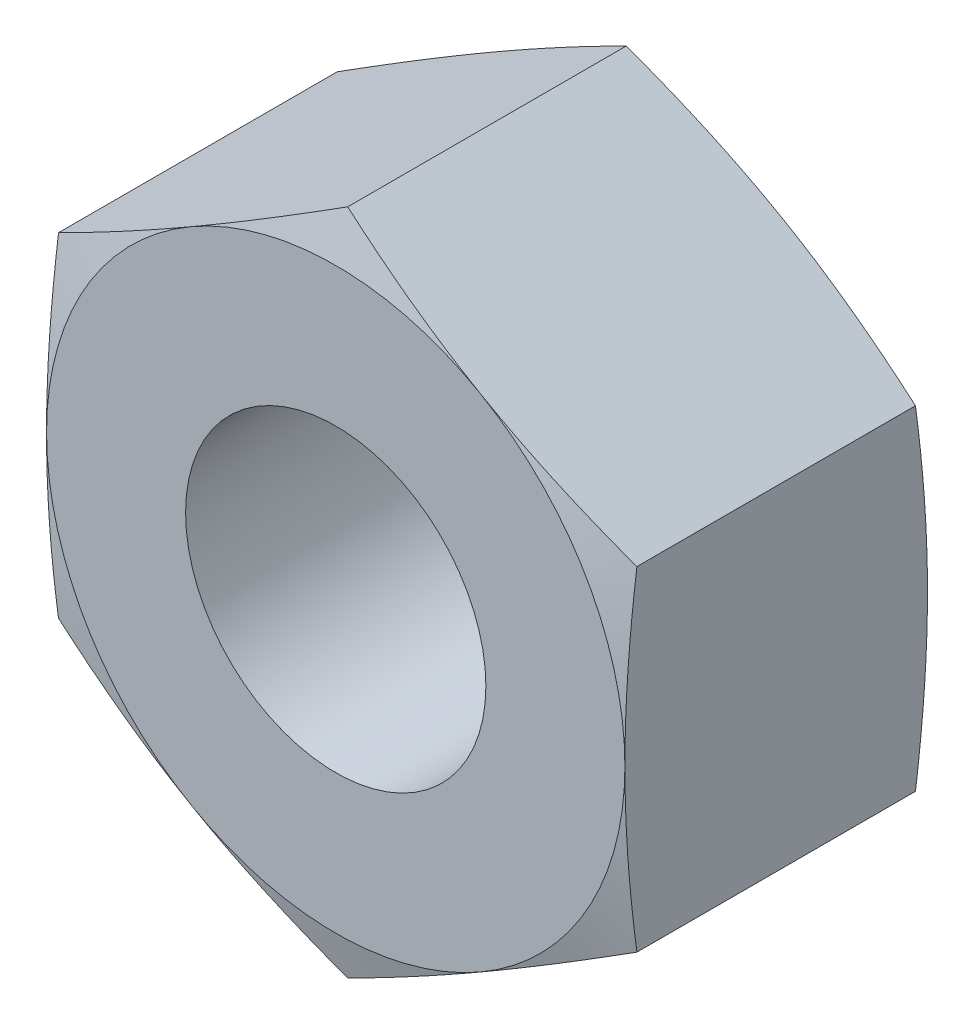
ISO-10303-21;
HEADER;
FILE_DESCRIPTION(('STEP AP214'),'2;1');
FILE_NAME('part.step','',(''),(''),'','','');
FILE_SCHEMA(('AUTOMOTIVE_DESIGN { 1 0 10303 214 1 1 1 1 }'));
ENDSEC;
DATA;
#1=APPLICATION_CONTEXT('core data for automotive mechanical design processes');
#2=APPLICATION_PROTOCOL_DEFINITION('international standard','automotive_design',2000,#1);
#3=PRODUCT_CONTEXT('',#1,'mechanical');
#4=PRODUCT('Part','Part','',(#3));
#5=PRODUCT_RELATED_PRODUCT_CATEGORY('part','',(#4));
#6=PRODUCT_DEFINITION_FORMATION('','',#4);
#7=PRODUCT_DEFINITION_CONTEXT('part definition',#1,'design');
#8=PRODUCT_DEFINITION('design','',#6,#7);
#9=PRODUCT_DEFINITION_SHAPE('','',#8);
#10=(LENGTH_UNIT() NAMED_UNIT(*) SI_UNIT(.MILLI.,.METRE.));
#11=(NAMED_UNIT(*) PLANE_ANGLE_UNIT() SI_UNIT($,.RADIAN.));
#12=(NAMED_UNIT(*) SI_UNIT($,.STERADIAN.) SOLID_ANGLE_UNIT());
#13=UNCERTAINTY_MEASURE_WITH_UNIT(LENGTH_MEASURE(1.E-05),#10,'distance_accuracy_value','');
#14=(GEOMETRIC_REPRESENTATION_CONTEXT(3) GLOBAL_UNCERTAINTY_ASSIGNED_CONTEXT((#13)) GLOBAL_UNIT_ASSIGNED_CONTEXT((#10,
#11,#12)) REPRESENTATION_CONTEXT('',''));
#15=CARTESIAN_POINT('',(0.,0.,0.));
#16=DIRECTION('',(0.,0.,1.));
#17=DIRECTION('',(1.,0.,0.));
#18=AXIS2_PLACEMENT_3D('',#15,#16,#17);
#19=CARTESIAN_POINT('',(0.,7.50555349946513,6.8));
#20=DIRECTION('',(0.5,-0.866025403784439,0.));
#21=DIRECTION('',(0.866025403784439,0.5,0.));
#22=AXIS2_PLACEMENT_3D('',#19,#20,#21);
#23=PLANE('',#22);
#24=CARTESIAN_POINT('',(-6.5002,3.75266127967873,0.269468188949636));
#25=CARTESIAN_POINT('',(-6.23025475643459,3.90851423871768,0.227689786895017));
#26=CARTESIAN_POINT('',(-5.95982006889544,4.06464977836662,0.189761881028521));
#27=CARTESIAN_POINT('',(-5.41799562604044,4.37747226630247,0.123126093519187));
#28=CARTESIAN_POINT('',(-5.14660552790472,4.53415941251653,0.0944219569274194));
#29=CARTESIAN_POINT('',(-4.60451571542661,4.84713511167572,0.0479094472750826));
#30=CARTESIAN_POINT('',(-4.33381966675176,5.00342154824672,0.030045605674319));
#31=CARTESIAN_POINT('',(-3.79208236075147,5.31619372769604,0.00609202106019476));
#32=CARTESIAN_POINT('',(-3.52104118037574,5.47267942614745,0.));
#33=CARTESIAN_POINT('',(-2.97895881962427,5.78565082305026,0.));
#34=CARTESIAN_POINT('',(-2.70791763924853,5.94213652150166,0.00609202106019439));
#35=CARTESIAN_POINT('',(-2.16618033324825,6.25490870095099,0.0300456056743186));
#36=CARTESIAN_POINT('',(-1.89548428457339,6.41119513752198,0.0479094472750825));
#37=CARTESIAN_POINT('',(-1.35339447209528,6.72417083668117,0.0944219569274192));
#38=CARTESIAN_POINT('',(-1.08200437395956,6.88085798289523,0.123126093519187));
#39=CARTESIAN_POINT('',(-0.540179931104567,7.19368047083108,0.189761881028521));
#40=CARTESIAN_POINT('',(-0.26974524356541,7.34981601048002,0.227689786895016));
#41=CARTESIAN_POINT('',(0.000199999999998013,7.50566896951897,0.269468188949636));
#42=B_SPLINE_CURVE_WITH_KNOTS('',3,(#24,#25,#26,#27,#28,#29,#30,#31,#32,#33,#34,#35,#36,#37,#38,
#39,#40,#41),.UNSPECIFIED.,.F.,.F.,(4,2,2,2,2,2,2,2,4),(0.,0.943529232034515,1.88744107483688,
2.82648138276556,3.76533995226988,4.70419852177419,5.64323882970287,6.58715067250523,
7.53067990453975),.UNSPECIFIED.);
#43=CARTESIAN_POINT('',(-6.5,3.75277674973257,0.269437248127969));
#44=VERTEX_POINT('',#43);
#45=CARTESIAN_POINT('',(-3.25,5.62916512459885,0.));
#46=VERTEX_POINT('',#45);
#47=EDGE_CURVE('E52',#44,#46,#42,.T.);
#48=ORIENTED_EDGE('',*,*,#47,.F.);
#49=DIRECTION('',(0.,0.,-1.));
#50=VECTOR('',#49,1.);
#51=CARTESIAN_POINT('',(-6.5,3.75277674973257,6.8));
#52=LINE('',#51,#50);
#53=CARTESIAN_POINT('',(-6.5,3.75277674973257,6.53056275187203));
#54=VERTEX_POINT('',#53);
#55=EDGE_CURVE('E276',#54,#44,#52,.T.);
#56=ORIENTED_EDGE('',*,*,#55,.F.);
#57=CARTESIAN_POINT('',(0.000200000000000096,7.50566896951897,6.53053181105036));
#58=CARTESIAN_POINT('',(-0.269745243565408,7.34981601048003,6.57231021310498));
#59=CARTESIAN_POINT('',(-0.540179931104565,7.19368047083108,6.61023811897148));
#60=CARTESIAN_POINT('',(-1.08200437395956,6.88085798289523,6.67687390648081));
#61=CARTESIAN_POINT('',(-1.35339447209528,6.72417083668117,6.70557804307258));
#62=CARTESIAN_POINT('',(-1.89548428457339,6.41119513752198,6.75209055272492));
#63=CARTESIAN_POINT('',(-2.16618033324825,6.25490870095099,6.76995439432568));
#64=CARTESIAN_POINT('',(-2.70791763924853,5.94213652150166,6.79390797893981));
#65=CARTESIAN_POINT('',(-2.97895881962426,5.78565082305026,6.8));
#66=CARTESIAN_POINT('',(-3.52104118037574,5.47267942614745,6.8));
#67=CARTESIAN_POINT('',(-3.79208236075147,5.31619372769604,6.79390797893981));
#68=CARTESIAN_POINT('',(-4.33381966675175,5.00342154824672,6.76995439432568));
#69=CARTESIAN_POINT('',(-4.60451571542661,4.84713511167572,6.75209055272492));
#70=CARTESIAN_POINT('',(-5.14660552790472,4.53415941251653,6.70557804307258));
#71=CARTESIAN_POINT('',(-5.41799562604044,4.37747226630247,6.67687390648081));
#72=CARTESIAN_POINT('',(-5.95982006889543,4.06464977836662,6.61023811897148));
#73=CARTESIAN_POINT('',(-6.23025475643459,3.90851423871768,6.57231021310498));
#74=CARTESIAN_POINT('',(-6.5002,3.75266127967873,6.53053181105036));
#75=B_SPLINE_CURVE_WITH_KNOTS('',3,(#57,#58,#59,#60,#61,#62,#63,#64,#65,#66,#67,#68,#69,#70,#71,
#72,#73,#74),.UNSPECIFIED.,.F.,.F.,(4,2,2,2,2,2,2,2,4),(0.,0.943529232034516,1.88744107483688,
2.82648138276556,3.76533995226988,4.70419852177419,5.64323882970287,6.58715067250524,
7.53067990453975),.UNSPECIFIED.);
#76=CARTESIAN_POINT('',(-3.25,5.62916512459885,6.8));
#77=VERTEX_POINT('',#76);
#78=EDGE_CURVE('E217',#77,#54,#75,.T.);
#79=ORIENTED_EDGE('',*,*,#78,.F.);
#80=CARTESIAN_POINT('',(0.,7.50555349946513,6.53056275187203));
#81=VERTEX_POINT('',#80);
#82=EDGE_CURVE('E297',#81,#77,#75,.T.);
#83=ORIENTED_EDGE('',*,*,#82,.F.);
#84=DIRECTION('',(0.,0.,-1.));
#85=VECTOR('',#84,1.);
#86=CARTESIAN_POINT('',(0.,7.50555349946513,6.8));
#87=LINE('',#86,#85);
#88=CARTESIAN_POINT('',(0.,7.50555349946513,0.269437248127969));
#89=VERTEX_POINT('',#88);
#90=EDGE_CURVE('E305',#81,#89,#87,.T.);
#91=ORIENTED_EDGE('',*,*,#90,.T.);
#92=EDGE_CURVE('E137',#46,#89,#42,.T.);
#93=ORIENTED_EDGE('',*,*,#92,.F.);
#94=EDGE_LOOP('',(#48,#56,#79,#83,#91,#93));
#95=FACE_BOUND('',#94,.T.);
#96=ADVANCED_FACE('F36',(#95),#23,.F.);
#97=CARTESIAN_POINT('',(-6.5,3.75277674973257,6.8));
#98=DIRECTION('',(1.,0.,0.));
#99=DIRECTION('',(0.,1.,0.));
#100=AXIS2_PLACEMENT_3D('',#97,#98,#99);
#101=PLANE('',#100);
#102=CARTESIAN_POINT('',(-6.5,-10.0232844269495,1.45935576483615));
#103=CARTESIAN_POINT('',(-6.5,-9.72709282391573,1.39278500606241));
#104=CARTESIAN_POINT('',(-6.5,-9.43071848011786,1.32701299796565));
#105=CARTESIAN_POINT('',(-6.5,-8.83751425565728,1.19749819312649));
#106=CARTESIAN_POINT('',(-6.5,-8.54068435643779,1.13375548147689));
#107=CARTESIAN_POINT('',(-6.5,-7.94623662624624,1.00868042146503));
#108=CARTESIAN_POINT('',(-6.5,-7.64861832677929,0.947350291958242));
#109=CARTESIAN_POINT('',(-6.5,-7.05276864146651,0.827745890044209));
#110=CARTESIAN_POINT('',(-6.5,-6.7545372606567,0.76947159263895));
#111=CARTESIAN_POINT('',(-6.5,-6.16011159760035,0.657230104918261));
#112=CARTESIAN_POINT('',(-6.5,-5.86392391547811,0.60322812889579));
#113=CARTESIAN_POINT('',(-6.5,-5.27074638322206,0.499834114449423));
#114=CARTESIAN_POINT('',(-6.5,-4.97375655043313,0.450441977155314));
#115=CARTESIAN_POINT('',(-6.5,-4.37889722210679,0.357357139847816));
#116=CARTESIAN_POINT('',(-6.5,-4.08102778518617,0.313664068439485));
#117=CARTESIAN_POINT('',(-6.5,-3.48433868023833,0.233247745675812));
#118=CARTESIAN_POINT('',(-6.5,-3.18551901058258,0.196524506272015));
#119=CARTESIAN_POINT('',(-6.5,-2.58348244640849,0.131060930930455));
#120=CARTESIAN_POINT('',(-6.5,-2.28025477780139,0.102418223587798));
#121=CARTESIAN_POINT('',(-6.5,-1.67301713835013,0.0550828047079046));
#122=CARTESIAN_POINT('',(-6.5,-1.36900718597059,0.0363898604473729));
#123=CARTESIAN_POINT('',(-6.5,-0.760665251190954,0.0100423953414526));
#124=CARTESIAN_POINT('',(-6.5,-0.456333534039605,0.00238187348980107));
#125=CARTESIAN_POINT('',(-6.5,0.152403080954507,-0.00143002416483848));
#126=CARTESIAN_POINT('',(-6.5,0.456807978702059,0.00241858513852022));
#127=CARTESIAN_POINT('',(-6.5,1.06671628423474,0.0214207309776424));
#128=CARTESIAN_POINT('',(-6.5,1.372217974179,0.0366283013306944));
#129=CARTESIAN_POINT('',(-6.5,1.98252546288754,0.0774863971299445));
#130=CARTESIAN_POINT('',(-6.5,2.28733122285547,0.10313749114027));
#131=CARTESIAN_POINT('',(-6.5,2.89624843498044,0.163562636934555));
#132=CARTESIAN_POINT('',(-6.5,3.2003592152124,0.198343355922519));
#133=CARTESIAN_POINT('',(-6.5,3.80759376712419,0.275550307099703));
#134=CARTESIAN_POINT('',(-6.5,4.11071754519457,0.317976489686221));
#135=CARTESIAN_POINT('',(-6.5,4.79985308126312,0.421697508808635));
#136=CARTESIAN_POINT('',(-6.5,5.18556608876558,0.484963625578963));
#137=CARTESIAN_POINT('',(-6.5,5.95564881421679,0.619239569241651));
#138=CARTESIAN_POINT('',(-6.5,6.34001844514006,0.690249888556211));
#139=CARTESIAN_POINT('',(-6.5,7.10771483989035,0.838146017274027));
#140=CARTESIAN_POINT('',(-6.5,7.49104132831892,0.915033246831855));
#141=CARTESIAN_POINT('',(-6.5,8.25675980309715,1.07326024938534));
#142=CARTESIAN_POINT('',(-6.5,8.6391518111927,1.15459991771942));
#143=CARTESIAN_POINT('',(-6.5,9.40344702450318,1.32075525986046));
#144=CARTESIAN_POINT('',(-6.5,9.78534972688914,1.40557323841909));
#145=CARTESIAN_POINT('',(-6.5,10.5485542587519,1.57787130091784));
#146=CARTESIAN_POINT('',(-6.5,10.9298560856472,1.66535139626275));
#147=CARTESIAN_POINT('',(-6.5,11.6919168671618,1.84239371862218));
#148=CARTESIAN_POINT('',(-6.5,12.0726758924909,1.93195564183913));
#149=CARTESIAN_POINT('',(-6.5,12.833796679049,2.11275339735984));
#150=CARTESIAN_POINT('',(-6.5,13.2141584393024,2.20398923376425));
#151=CARTESIAN_POINT('',(-6.5,14.3418561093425,2.47658764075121));
#152=CARTESIAN_POINT('',(-6.5,15.0887278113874,2.65986966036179));
#153=CARTESIAN_POINT('',(-6.5,16.5816327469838,3.02993952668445));
#154=CARTESIAN_POINT('',(-6.5,17.3276659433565,3.21672752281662));
#155=CARTESIAN_POINT('',(-6.5,18.8176034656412,3.59239302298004));
#156=CARTESIAN_POINT('',(-6.5,19.5615090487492,3.78126554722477));
#157=CARTESIAN_POINT('',(-6.5,21.0488117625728,4.1608382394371));
#158=CARTESIAN_POINT('',(-6.5,21.7922089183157,4.35153830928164));
#159=CARTESIAN_POINT('',(-6.5,22.5354477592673,4.54284653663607));
#160=B_SPLINE_CURVE_WITH_KNOTS('',3,(#102,#103,#104,#105,#106,#107,#108,#109,#110,#111,#112,
#113,#114,#115,#116,#117,#118,#119,#120,#121,#122,#123,#124,#125,#126,#127,#128,#129,#130,#131,
#132,#133,#134,#135,#136,#137,#138,#139,#140,#141,#142,#143,#144,#145,#146,#147,#148,#149,#150,
#151,#152,#153,#154,#155,#156,#157,#158,#159),.UNSPECIFIED.,.F.,.F.,(4,2,2,2,2,2,2,2,2,2,2,2,2,
2,2,2,2,2,2,2,2,2,2,2,2,2,2,2,4),(0.,0.910745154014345,1.82152844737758,2.73313068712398,
3.64472546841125,4.5479074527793,5.45107006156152,6.35417378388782,7.25727905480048,
8.1708690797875,9.08443773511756,9.99750927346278,10.9105796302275,11.8280212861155,
12.7455128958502,13.663676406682,14.5818339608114,15.7543247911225,16.9268902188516,
18.0997398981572,19.2725620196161,20.4461742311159,21.6197914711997,22.7932385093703,
23.9666884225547,26.2737687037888,28.5809475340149,30.8834684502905,33.185866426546),.UNSPECIFIED.);
#161=CARTESIAN_POINT('',(-6.5,-3.75277674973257,0.269437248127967));
#162=VERTEX_POINT('',#161);
#163=CARTESIAN_POINT('',(-6.5,0.,0.));
#164=VERTEX_POINT('',#163);
#165=EDGE_CURVE('E60',#162,#164,#160,.T.);
#166=ORIENTED_EDGE('',*,*,#165,.F.);
#167=DIRECTION('',(0.,0.,-1.));
#168=VECTOR('',#167,1.);
#169=CARTESIAN_POINT('',(-6.5,-3.75277674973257,6.8));
#170=LINE('',#169,#168);
#171=CARTESIAN_POINT('',(-6.5,-3.75277674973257,6.53056275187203));
#172=VERTEX_POINT('',#171);
#173=EDGE_CURVE('E274',#172,#162,#170,.T.);
#174=ORIENTED_EDGE('',*,*,#173,.F.);
#175=CARTESIAN_POINT('',(-6.5,-10.0232844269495,5.34064423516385));
#176=CARTESIAN_POINT('',(-6.5,-9.72709282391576,5.40721499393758));
#177=CARTESIAN_POINT('',(-6.5,-9.43071848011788,5.47298700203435));
#178=CARTESIAN_POINT('',(-6.5,-8.83751425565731,5.60250180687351));
#179=CARTESIAN_POINT('',(-6.5,-8.54068435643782,5.66624451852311));
#180=CARTESIAN_POINT('',(-6.5,-7.94623662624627,5.79131957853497));
#181=CARTESIAN_POINT('',(-6.5,-7.64861832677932,5.85264970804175));
#182=CARTESIAN_POINT('',(-6.5,-7.05276864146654,5.97225410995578));
#183=CARTESIAN_POINT('',(-6.5,-6.75453726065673,6.03052840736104));
#184=CARTESIAN_POINT('',(-6.5,-6.16011159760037,6.14276989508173));
#185=CARTESIAN_POINT('',(-6.5,-5.86392391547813,6.19677187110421));
#186=CARTESIAN_POINT('',(-6.5,-5.27074638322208,6.30016588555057));
#187=CARTESIAN_POINT('',(-6.5,-4.97375655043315,6.34955802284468));
#188=CARTESIAN_POINT('',(-6.5,-4.37889722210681,6.44264286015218));
#189=CARTESIAN_POINT('',(-6.5,-4.08102778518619,6.48633593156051));
#190=CARTESIAN_POINT('',(-6.5,-3.48433868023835,6.56675225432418));
#191=CARTESIAN_POINT('',(-6.5,-3.1855190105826,6.60347549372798));
#192=CARTESIAN_POINT('',(-6.5,-2.58348244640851,6.66893906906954));
#193=CARTESIAN_POINT('',(-6.5,-2.28025477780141,6.6975817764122));
#194=CARTESIAN_POINT('',(-6.5,-1.67301713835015,6.74491719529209));
#195=CARTESIAN_POINT('',(-6.5,-1.36900718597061,6.76361013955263));
#196=CARTESIAN_POINT('',(-6.5,-0.760665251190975,6.78995760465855));
#197=CARTESIAN_POINT('',(-6.5,-0.456333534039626,6.7976181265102));
#198=CARTESIAN_POINT('',(-6.5,0.152403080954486,6.80143002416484));
#199=CARTESIAN_POINT('',(-6.5,0.456807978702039,6.79758141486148));
#200=CARTESIAN_POINT('',(-6.5,1.06671628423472,6.77857926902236));
#201=CARTESIAN_POINT('',(-6.5,1.37221797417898,6.76337169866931));
#202=CARTESIAN_POINT('',(-6.5,1.98252546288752,6.72251360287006));
#203=CARTESIAN_POINT('',(-6.5,2.28733122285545,6.69686250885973));
#204=CARTESIAN_POINT('',(-6.5,2.89624843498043,6.63643736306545));
#205=CARTESIAN_POINT('',(-6.5,3.20035921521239,6.60165664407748));
#206=CARTESIAN_POINT('',(-6.5,3.80759376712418,6.5244496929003));
#207=CARTESIAN_POINT('',(-6.5,4.11071754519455,6.48202351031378));
#208=CARTESIAN_POINT('',(-6.5,4.79985308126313,6.37830249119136));
#209=CARTESIAN_POINT('',(-6.5,5.18556608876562,6.31503637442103));
#210=CARTESIAN_POINT('',(-6.5,5.95564881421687,6.18076043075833));
#211=CARTESIAN_POINT('',(-6.5,6.34001844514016,6.10975011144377));
#212=CARTESIAN_POINT('',(-6.5,7.10771483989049,5.96185398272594));
#213=CARTESIAN_POINT('',(-6.5,7.49104132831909,5.88496675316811));
#214=CARTESIAN_POINT('',(-6.5,8.25675980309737,5.72673975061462));
#215=CARTESIAN_POINT('',(-6.5,8.63915181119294,5.64540008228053));
#216=CARTESIAN_POINT('',(-6.5,9.40344702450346,5.47924474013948));
#217=CARTESIAN_POINT('',(-6.5,9.78534972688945,5.39442676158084));
#218=CARTESIAN_POINT('',(-6.5,10.5485542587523,5.22212869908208));
#219=CARTESIAN_POINT('',(-6.5,10.9298560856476,5.13464860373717));
#220=CARTESIAN_POINT('',(-6.5,11.6919168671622,4.95760628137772));
#221=CARTESIAN_POINT('',(-6.5,12.0726758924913,4.86804435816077));
#222=CARTESIAN_POINT('',(-6.5,12.8337966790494,4.68724660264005));
#223=CARTESIAN_POINT('',(-6.5,13.2141584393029,4.59601076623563));
#224=CARTESIAN_POINT('',(-6.5,14.341856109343,4.32341235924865));
#225=CARTESIAN_POINT('',(-6.5,15.088727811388,4.14013033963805));
#226=CARTESIAN_POINT('',(-6.5,16.5816327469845,3.77006047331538));
#227=CARTESIAN_POINT('',(-6.5,17.3276659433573,3.58327247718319));
#228=CARTESIAN_POINT('',(-6.5,18.8176034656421,3.20760697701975));
#229=CARTESIAN_POINT('',(-6.5,19.5615090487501,3.018734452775));
#230=CARTESIAN_POINT('',(-6.5,21.0488117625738,2.63916176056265));
#231=CARTESIAN_POINT('',(-6.5,21.7922089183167,2.44846169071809));
#232=CARTESIAN_POINT('',(-6.5,22.5354477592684,2.25715346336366));
#233=B_SPLINE_CURVE_WITH_KNOTS('',3,(#175,#176,#177,#178,#179,#180,#181,#182,#183,#184,#185,
#186,#187,#188,#189,#190,#191,#192,#193,#194,#195,#196,#197,#198,#199,#200,#201,#202,#203,#204,
#205,#206,#207,#208,#209,#210,#211,#212,#213,#214,#215,#216,#217,#218,#219,#220,#221,#222,#223,
#224,#225,#226,#227,#228,#229,#230,#231,#232),.UNSPECIFIED.,.F.,.F.,(4,2,2,2,2,2,2,2,2,2,2,2,2,
2,2,2,2,2,2,2,2,2,2,2,2,2,2,2,4),(0.,0.910745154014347,1.82152844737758,2.73313068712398,
3.64472546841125,4.54790745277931,5.45107006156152,6.35417378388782,7.25727905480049,
8.1708690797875,9.08443773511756,9.99750927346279,10.9105796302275,11.8280212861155,
12.7455128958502,13.663676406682,14.5818339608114,15.7543247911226,16.9268902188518,
18.0997398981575,19.2725620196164,20.4461742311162,21.6197914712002,22.7932385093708,
23.9666884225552,26.2737687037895,28.5809475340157,30.8834684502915,33.1858664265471),.UNSPECIFIED.);
#234=CARTESIAN_POINT('',(-6.5,0.,6.8));
#235=VERTEX_POINT('',#234);
#236=EDGE_CURVE('E237',#235,#172,#233,.F.);
#237=ORIENTED_EDGE('',*,*,#236,.F.);
#238=EDGE_CURVE('E313',#54,#235,#233,.F.);
#239=ORIENTED_EDGE('',*,*,#238,.F.);
#240=ORIENTED_EDGE('',*,*,#55,.T.);
#241=EDGE_CURVE('E159',#164,#44,#160,.T.);
#242=ORIENTED_EDGE('',*,*,#241,.F.);
#243=EDGE_LOOP('',(#166,#174,#237,#239,#240,#242));
#244=FACE_BOUND('',#243,.T.);
#245=ADVANCED_FACE('F244',(#244),#101,.F.);
#246=CARTESIAN_POINT('',(0.,-7.50555349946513,6.8));
#247=DIRECTION('',(0.5,0.866025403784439,0.));
#248=DIRECTION('',(-0.866025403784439,0.5,0.));
#249=AXIS2_PLACEMENT_3D('',#246,#247,#248);
#250=PLANE('',#249);
#251=CARTESIAN_POINT('',(0.000200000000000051,-7.50566896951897,0.269468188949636));
#252=CARTESIAN_POINT('',(-0.269745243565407,-7.34981601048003,0.227689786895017));
#253=CARTESIAN_POINT('',(-0.540179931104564,-7.19368047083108,0.189761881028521));
#254=CARTESIAN_POINT('',(-1.08200437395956,-6.88085798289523,0.123126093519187));
#255=CARTESIAN_POINT('',(-1.35339447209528,-6.72417083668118,0.0944219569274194));
#256=CARTESIAN_POINT('',(-1.89548428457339,-6.41119513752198,0.0479094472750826));
#257=CARTESIAN_POINT('',(-2.16618033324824,-6.25490870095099,0.0300456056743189));
#258=CARTESIAN_POINT('',(-2.70791763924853,-5.94213652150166,0.00609202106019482));
#259=CARTESIAN_POINT('',(-2.97895881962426,-5.78565082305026,0.));
#260=CARTESIAN_POINT('',(-3.52104118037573,-5.47267942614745,0.));
#261=CARTESIAN_POINT('',(-3.79208236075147,-5.31619372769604,0.00609202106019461));
#262=CARTESIAN_POINT('',(-4.33381966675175,-5.00342154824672,0.0300456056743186));
#263=CARTESIAN_POINT('',(-4.60451571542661,-4.84713511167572,0.0479094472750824));
#264=CARTESIAN_POINT('',(-5.14660552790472,-4.53415941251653,0.0944219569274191));
#265=CARTESIAN_POINT('',(-5.41799562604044,-4.37747226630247,0.123126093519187));
#266=CARTESIAN_POINT('',(-5.95982006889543,-4.06464977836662,0.189761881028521));
#267=CARTESIAN_POINT('',(-6.23025475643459,-3.90851423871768,0.227689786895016));
#268=CARTESIAN_POINT('',(-6.5002,-3.75266127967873,0.269468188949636));
#269=B_SPLINE_CURVE_WITH_KNOTS('',3,(#251,#252,#253,#254,#255,#256,#257,#258,#259,#260,#261,
#262,#263,#264,#265,#266,#267,#268),.UNSPECIFIED.,.F.,.F.,(4,2,2,2,2,2,2,2,4),(0.,
0.943529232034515,1.88744107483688,2.82648138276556,3.76533995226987,4.70419852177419,
5.64323882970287,6.58715067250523,7.53067990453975),.UNSPECIFIED.);
#270=CARTESIAN_POINT('',(0.,-7.50555349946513,0.269437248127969));
#271=VERTEX_POINT('',#270);
#272=CARTESIAN_POINT('',(-3.25,-5.62916512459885,0.));
#273=VERTEX_POINT('',#272);
#274=EDGE_CURVE('E253',#271,#273,#269,.T.);
#275=ORIENTED_EDGE('',*,*,#274,.F.);
#276=DIRECTION('',(0.,0.,-1.));
#277=VECTOR('',#276,1.);
#278=CARTESIAN_POINT('',(0.,-7.50555349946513,6.8));
#279=LINE('',#278,#277);
#280=CARTESIAN_POINT('',(0.,-7.50555349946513,6.53056275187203));
#281=VERTEX_POINT('',#280);
#282=EDGE_CURVE('E268',#281,#271,#279,.T.);
#283=ORIENTED_EDGE('',*,*,#282,.F.);
#284=CARTESIAN_POINT('',(-6.5002,-3.75266127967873,6.53053181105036));
#285=CARTESIAN_POINT('',(-6.23025475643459,-3.90851423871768,6.57231021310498));
#286=CARTESIAN_POINT('',(-5.95982006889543,-4.06464977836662,6.61023811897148));
#287=CARTESIAN_POINT('',(-5.41799562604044,-4.37747226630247,6.67687390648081));
#288=CARTESIAN_POINT('',(-5.14660552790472,-4.53415941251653,6.70557804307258));
#289=CARTESIAN_POINT('',(-4.60451571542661,-4.84713511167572,6.75209055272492));
#290=CARTESIAN_POINT('',(-4.33381966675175,-5.00342154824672,6.76995439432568));
#291=CARTESIAN_POINT('',(-3.79208236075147,-5.31619372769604,6.79390797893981));
#292=CARTESIAN_POINT('',(-3.52104118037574,-5.47267942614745,6.8));
#293=CARTESIAN_POINT('',(-2.97895881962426,-5.78565082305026,6.8));
#294=CARTESIAN_POINT('',(-2.70791763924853,-5.94213652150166,6.79390797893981));
#295=CARTESIAN_POINT('',(-2.16618033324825,-6.25490870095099,6.76995439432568));
#296=CARTESIAN_POINT('',(-1.89548428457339,-6.41119513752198,6.75209055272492));
#297=CARTESIAN_POINT('',(-1.35339447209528,-6.72417083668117,6.70557804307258));
#298=CARTESIAN_POINT('',(-1.08200437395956,-6.88085798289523,6.67687390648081));
#299=CARTESIAN_POINT('',(-0.540179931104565,-7.19368047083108,6.61023811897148));
#300=CARTESIAN_POINT('',(-0.269745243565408,-7.34981601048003,6.57231021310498));
#301=CARTESIAN_POINT('',(0.000199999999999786,-7.50566896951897,6.53053181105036));
#302=B_SPLINE_CURVE_WITH_KNOTS('',3,(#284,#285,#286,#287,#288,#289,#290,#291,#292,#293,#294,
#295,#296,#297,#298,#299,#300,#301),.UNSPECIFIED.,.F.,.F.,(4,2,2,2,2,2,2,2,4),(0.,
0.943529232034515,1.88744107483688,2.82648138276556,3.76533995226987,4.70419852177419,
5.64323882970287,6.58715067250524,7.53067990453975),.UNSPECIFIED.);
#303=CARTESIAN_POINT('',(-3.25,-5.62916512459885,6.8));
#304=VERTEX_POINT('',#303);
#305=EDGE_CURVE('E231',#304,#281,#302,.T.);
#306=ORIENTED_EDGE('',*,*,#305,.F.);
#307=EDGE_CURVE('E235',#172,#304,#302,.T.);
#308=ORIENTED_EDGE('',*,*,#307,.F.);
#309=ORIENTED_EDGE('',*,*,#173,.T.);
#310=EDGE_CURVE('E248',#273,#162,#269,.T.);
#311=ORIENTED_EDGE('',*,*,#310,.F.);
#312=EDGE_LOOP('',(#275,#283,#306,#308,#309,#311));
#313=FACE_BOUND('',#312,.T.);
#314=ADVANCED_FACE('F241',(#313),#250,.F.);
#315=CARTESIAN_POINT('',(0.,-7.50555349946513,6.8));
#316=DIRECTION('',(-0.5,0.866025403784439,0.));
#317=DIRECTION('',(-0.866025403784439,-0.5,0.));
#318=AXIS2_PLACEMENT_3D('',#315,#316,#317);
#319=PLANE('',#318);
#320=CARTESIAN_POINT('',(6.5002,-3.75266127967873,0.269468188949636));
#321=CARTESIAN_POINT('',(6.23025475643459,-3.90851423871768,0.227689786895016));
#322=CARTESIAN_POINT('',(5.95982006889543,-4.06464977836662,0.189761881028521));
#323=CARTESIAN_POINT('',(5.41799562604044,-4.37747226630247,0.123126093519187));
#324=CARTESIAN_POINT('',(5.14660552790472,-4.53415941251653,0.0944219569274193));
#325=CARTESIAN_POINT('',(4.60451571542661,-4.84713511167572,0.0479094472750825));
#326=CARTESIAN_POINT('',(4.33381966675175,-5.00342154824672,0.0300456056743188));
#327=CARTESIAN_POINT('',(3.79208236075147,-5.31619372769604,0.00609202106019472));
#328=CARTESIAN_POINT('',(3.52104118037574,-5.47267942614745,0.));
#329=CARTESIAN_POINT('',(2.97895881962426,-5.78565082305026,0.));
#330=CARTESIAN_POINT('',(2.70791763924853,-5.94213652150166,0.00609202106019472));
#331=CARTESIAN_POINT('',(2.16618033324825,-6.25490870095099,0.0300456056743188));
#332=CARTESIAN_POINT('',(1.89548428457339,-6.41119513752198,0.0479094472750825));
#333=CARTESIAN_POINT('',(1.35339447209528,-6.72417083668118,0.0944219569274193));
#334=CARTESIAN_POINT('',(1.08200437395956,-6.88085798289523,0.123126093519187));
#335=CARTESIAN_POINT('',(0.540179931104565,-7.19368047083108,0.189761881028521));
#336=CARTESIAN_POINT('',(0.269745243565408,-7.34981601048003,0.227689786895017));
#337=CARTESIAN_POINT('',(-0.000199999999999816,-7.50566896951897,0.269468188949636));
#338=B_SPLINE_CURVE_WITH_KNOTS('',3,(#320,#321,#322,#323,#324,#325,#326,#327,#328,#329,#330,
#331,#332,#333,#334,#335,#336,#337),.UNSPECIFIED.,.F.,.F.,(4,2,2,2,2,2,2,2,4),(0.,
0.943529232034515,1.88744107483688,2.82648138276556,3.76533995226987,4.70419852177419,
5.64323882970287,6.58715067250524,7.53067990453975),.UNSPECIFIED.);
#339=CARTESIAN_POINT('',(6.5,-3.75277674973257,0.269437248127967));
#340=VERTEX_POINT('',#339);
#341=CARTESIAN_POINT('',(3.25,-5.62916512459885,0.));
#342=VERTEX_POINT('',#341);
#343=EDGE_CURVE('E146',#340,#342,#338,.T.);
#344=ORIENTED_EDGE('',*,*,#343,.F.);
#345=DIRECTION('',(0.,0.,-1.));
#346=VECTOR('',#345,1.);
#347=CARTESIAN_POINT('',(6.5,-3.75277674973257,6.8));
#348=LINE('',#347,#346);
#349=CARTESIAN_POINT('',(6.5,-3.75277674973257,6.53056275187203));
#350=VERTEX_POINT('',#349);
#351=EDGE_CURVE('E158',#350,#340,#348,.T.);
#352=ORIENTED_EDGE('',*,*,#351,.F.);
#353=CARTESIAN_POINT('',(-0.000200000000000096,-7.50566896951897,6.53053181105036));
#354=CARTESIAN_POINT('',(0.269745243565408,-7.34981601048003,6.57231021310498));
#355=CARTESIAN_POINT('',(0.540179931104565,-7.19368047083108,6.61023811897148));
#356=CARTESIAN_POINT('',(1.08200437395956,-6.88085798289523,6.67687390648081));
#357=CARTESIAN_POINT('',(1.35339447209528,-6.72417083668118,6.70557804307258));
#358=CARTESIAN_POINT('',(1.89548428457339,-6.41119513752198,6.75209055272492));
#359=CARTESIAN_POINT('',(2.16618033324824,-6.25490870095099,6.76995439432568));
#360=CARTESIAN_POINT('',(2.70791763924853,-5.94213652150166,6.79390797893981));
#361=CARTESIAN_POINT('',(2.97895881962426,-5.78565082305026,6.8));
#362=CARTESIAN_POINT('',(3.52104118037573,-5.47267942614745,6.8));
#363=CARTESIAN_POINT('',(3.79208236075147,-5.31619372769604,6.79390797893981));
#364=CARTESIAN_POINT('',(4.33381966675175,-5.00342154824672,6.76995439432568));
#365=CARTESIAN_POINT('',(4.60451571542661,-4.84713511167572,6.75209055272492));
#366=CARTESIAN_POINT('',(5.14660552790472,-4.53415941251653,6.70557804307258));
#367=CARTESIAN_POINT('',(5.41799562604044,-4.37747226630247,6.67687390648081));
#368=CARTESIAN_POINT('',(5.95982006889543,-4.06464977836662,6.61023811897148));
#369=CARTESIAN_POINT('',(6.23025475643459,-3.90851423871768,6.57231021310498));
#370=CARTESIAN_POINT('',(6.5002,-3.75266127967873,6.53053181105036));
#371=B_SPLINE_CURVE_WITH_KNOTS('',3,(#353,#354,#355,#356,#357,#358,#359,#360,#361,#362,#363,
#364,#365,#366,#367,#368,#369,#370),.UNSPECIFIED.,.F.,.F.,(4,2,2,2,2,2,2,2,4),(0.,
0.943529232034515,1.88744107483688,2.82648138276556,3.76533995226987,4.70419852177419,
5.64323882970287,6.58715067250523,7.53067990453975),.UNSPECIFIED.);
#372=CARTESIAN_POINT('',(3.25,-5.62916512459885,6.8));
#373=VERTEX_POINT('',#372);
#374=EDGE_CURVE('E200',#373,#350,#371,.T.);
#375=ORIENTED_EDGE('',*,*,#374,.F.);
#376=EDGE_CURVE('E236',#281,#373,#371,.T.);
#377=ORIENTED_EDGE('',*,*,#376,.F.);
#378=ORIENTED_EDGE('',*,*,#282,.T.);
#379=EDGE_CURVE('E161',#342,#271,#338,.T.);
#380=ORIENTED_EDGE('',*,*,#379,.F.);
#381=EDGE_LOOP('',(#344,#352,#375,#377,#378,#380));
#382=FACE_BOUND('',#381,.T.);
#383=ADVANCED_FACE('F184',(#382),#319,.F.);
#384=CARTESIAN_POINT('',(6.5,3.75277674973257,6.8));
#385=DIRECTION('',(-1.,0.,0.));
#386=DIRECTION('',(0.,-1.,0.));
#387=AXIS2_PLACEMENT_3D('',#384,#385,#386);
#388=PLANE('',#387);
#389=CARTESIAN_POINT('',(6.5,-10.0232844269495,1.45935576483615));
#390=CARTESIAN_POINT('',(6.5,-9.72709282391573,1.39278500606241));
#391=CARTESIAN_POINT('',(6.5,-9.43071848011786,1.32701299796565));
#392=CARTESIAN_POINT('',(6.5,-8.83751425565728,1.19749819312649));
#393=CARTESIAN_POINT('',(6.5,-8.54068435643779,1.13375548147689));
#394=CARTESIAN_POINT('',(6.5,-7.94623662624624,1.00868042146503));
#395=CARTESIAN_POINT('',(6.5,-7.64861832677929,0.947350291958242));
#396=CARTESIAN_POINT('',(6.5,-7.05276864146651,0.827745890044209));
#397=CARTESIAN_POINT('',(6.5,-6.7545372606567,0.76947159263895));
#398=CARTESIAN_POINT('',(6.5,-6.16011159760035,0.657230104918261));
#399=CARTESIAN_POINT('',(6.5,-5.86392391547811,0.60322812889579));
#400=CARTESIAN_POINT('',(6.5,-5.27074638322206,0.499834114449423));
#401=CARTESIAN_POINT('',(6.5,-4.97375655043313,0.450441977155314));
#402=CARTESIAN_POINT('',(6.5,-4.37889722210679,0.357357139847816));
#403=CARTESIAN_POINT('',(6.5,-4.08102778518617,0.313664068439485));
#404=CARTESIAN_POINT('',(6.5,-3.48433868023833,0.233247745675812));
#405=CARTESIAN_POINT('',(6.5,-3.18551901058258,0.196524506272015));
#406=CARTESIAN_POINT('',(6.5,-2.58348244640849,0.131060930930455));
#407=CARTESIAN_POINT('',(6.5,-2.28025477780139,0.102418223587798));
#408=CARTESIAN_POINT('',(6.5,-1.67301713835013,0.0550828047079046));
#409=CARTESIAN_POINT('',(6.5,-1.36900718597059,0.0363898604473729));
#410=CARTESIAN_POINT('',(6.5,-0.760665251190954,0.0100423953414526));
#411=CARTESIAN_POINT('',(6.5,-0.456333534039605,0.00238187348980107));
#412=CARTESIAN_POINT('',(6.5,0.152403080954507,-0.00143002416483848));
#413=CARTESIAN_POINT('',(6.5,0.456807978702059,0.00241858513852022));
#414=CARTESIAN_POINT('',(6.5,1.06671628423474,0.0214207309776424));
#415=CARTESIAN_POINT('',(6.5,1.372217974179,0.0366283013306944));
#416=CARTESIAN_POINT('',(6.5,1.98252546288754,0.0774863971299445));
#417=CARTESIAN_POINT('',(6.5,2.28733122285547,0.10313749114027));
#418=CARTESIAN_POINT('',(6.5,2.89624843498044,0.163562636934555));
#419=CARTESIAN_POINT('',(6.5,3.2003592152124,0.198343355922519));
#420=CARTESIAN_POINT('',(6.5,3.80759376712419,0.275550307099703));
#421=CARTESIAN_POINT('',(6.5,4.11071754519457,0.317976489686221));
#422=CARTESIAN_POINT('',(6.5,4.79985308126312,0.421697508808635));
#423=CARTESIAN_POINT('',(6.5,5.18556608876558,0.484963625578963));
#424=CARTESIAN_POINT('',(6.5,5.95564881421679,0.619239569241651));
#425=CARTESIAN_POINT('',(6.5,6.34001844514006,0.690249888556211));
#426=CARTESIAN_POINT('',(6.5,7.10771483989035,0.838146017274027));
#427=CARTESIAN_POINT('',(6.5,7.49104132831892,0.915033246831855));
#428=CARTESIAN_POINT('',(6.5,8.25675980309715,1.07326024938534));
#429=CARTESIAN_POINT('',(6.5,8.6391518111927,1.15459991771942));
#430=CARTESIAN_POINT('',(6.5,9.40344702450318,1.32075525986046));
#431=CARTESIAN_POINT('',(6.5,9.78534972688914,1.40557323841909));
#432=CARTESIAN_POINT('',(6.5,10.5485542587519,1.57787130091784));
#433=CARTESIAN_POINT('',(6.5,10.9298560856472,1.66535139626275));
#434=CARTESIAN_POINT('',(6.5,11.6919168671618,1.84239371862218));
#435=CARTESIAN_POINT('',(6.5,12.0726758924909,1.93195564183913));
#436=CARTESIAN_POINT('',(6.5,12.833796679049,2.11275339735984));
#437=CARTESIAN_POINT('',(6.5,13.2141584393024,2.20398923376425));
#438=CARTESIAN_POINT('',(6.5,14.3418561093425,2.47658764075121));
#439=CARTESIAN_POINT('',(6.5,15.0887278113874,2.65986966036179));
#440=CARTESIAN_POINT('',(6.5,16.5816327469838,3.02993952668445));
#441=CARTESIAN_POINT('',(6.5,17.3276659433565,3.21672752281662));
#442=CARTESIAN_POINT('',(6.5,18.8176034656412,3.59239302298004));
#443=CARTESIAN_POINT('',(6.5,19.5615090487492,3.78126554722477));
#444=CARTESIAN_POINT('',(6.5,21.0488117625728,4.1608382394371));
#445=CARTESIAN_POINT('',(6.5,21.7922089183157,4.35153830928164));
#446=CARTESIAN_POINT('',(6.5,22.5354477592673,4.54284653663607));
#447=B_SPLINE_CURVE_WITH_KNOTS('',3,(#389,#390,#391,#392,#393,#394,#395,#396,#397,#398,#399,
#400,#401,#402,#403,#404,#405,#406,#407,#408,#409,#410,#411,#412,#413,#414,#415,#416,#417,#418,
#419,#420,#421,#422,#423,#424,#425,#426,#427,#428,#429,#430,#431,#432,#433,#434,#435,#436,#437,
#438,#439,#440,#441,#442,#443,#444,#445,#446),.UNSPECIFIED.,.F.,.F.,(4,2,2,2,2,2,2,2,2,2,2,2,2,
2,2,2,2,2,2,2,2,2,2,2,2,2,2,2,4),(0.,0.910745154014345,1.82152844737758,2.73313068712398,
3.64472546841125,4.5479074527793,5.45107006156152,6.35417378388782,7.25727905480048,
8.1708690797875,9.08443773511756,9.99750927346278,10.9105796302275,11.8280212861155,
12.7455128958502,13.663676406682,14.5818339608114,15.7543247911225,16.9268902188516,
18.0997398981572,19.2725620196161,20.4461742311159,21.6197914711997,22.7932385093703,
23.9666884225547,26.2737687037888,28.5809475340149,30.8834684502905,33.185866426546),.UNSPECIFIED.);
#448=CARTESIAN_POINT('',(6.5,3.75277674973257,0.269437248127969));
#449=VERTEX_POINT('',#448);
#450=CARTESIAN_POINT('',(6.5,0.,0.));
#451=VERTEX_POINT('',#450);
#452=EDGE_CURVE('E126',#449,#451,#447,.F.);
#453=ORIENTED_EDGE('',*,*,#452,.F.);
#454=DIRECTION('',(0.,0.,-1.));
#455=VECTOR('',#454,1.);
#456=CARTESIAN_POINT('',(6.5,3.75277674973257,6.8));
#457=LINE('',#456,#455);
#458=CARTESIAN_POINT('',(6.5,3.75277674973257,6.53056275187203));
#459=VERTEX_POINT('',#458);
#460=EDGE_CURVE('E278',#459,#449,#457,.T.);
#461=ORIENTED_EDGE('',*,*,#460,.F.);
#462=CARTESIAN_POINT('',(6.5,-10.0232844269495,5.34064423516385));
#463=CARTESIAN_POINT('',(6.5,-9.72709282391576,5.40721499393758));
#464=CARTESIAN_POINT('',(6.5,-9.43071848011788,5.47298700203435));
#465=CARTESIAN_POINT('',(6.5,-8.83751425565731,5.60250180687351));
#466=CARTESIAN_POINT('',(6.5,-8.54068435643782,5.66624451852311));
#467=CARTESIAN_POINT('',(6.5,-7.94623662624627,5.79131957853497));
#468=CARTESIAN_POINT('',(6.5,-7.64861832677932,5.85264970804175));
#469=CARTESIAN_POINT('',(6.5,-7.05276864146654,5.97225410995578));
#470=CARTESIAN_POINT('',(6.5,-6.75453726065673,6.03052840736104));
#471=CARTESIAN_POINT('',(6.5,-6.16011159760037,6.14276989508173));
#472=CARTESIAN_POINT('',(6.5,-5.86392391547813,6.19677187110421));
#473=CARTESIAN_POINT('',(6.5,-5.27074638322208,6.30016588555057));
#474=CARTESIAN_POINT('',(6.5,-4.97375655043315,6.34955802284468));
#475=CARTESIAN_POINT('',(6.5,-4.37889722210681,6.44264286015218));
#476=CARTESIAN_POINT('',(6.5,-4.08102778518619,6.48633593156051));
#477=CARTESIAN_POINT('',(6.5,-3.48433868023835,6.56675225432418));
#478=CARTESIAN_POINT('',(6.5,-3.1855190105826,6.60347549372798));
#479=CARTESIAN_POINT('',(6.5,-2.58348244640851,6.66893906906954));
#480=CARTESIAN_POINT('',(6.5,-2.28025477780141,6.6975817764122));
#481=CARTESIAN_POINT('',(6.5,-1.67301713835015,6.74491719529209));
#482=CARTESIAN_POINT('',(6.5,-1.36900718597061,6.76361013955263));
#483=CARTESIAN_POINT('',(6.5,-0.760665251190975,6.78995760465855));
#484=CARTESIAN_POINT('',(6.5,-0.456333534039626,6.7976181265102));
#485=CARTESIAN_POINT('',(6.5,0.152403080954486,6.80143002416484));
#486=CARTESIAN_POINT('',(6.5,0.456807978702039,6.79758141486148));
#487=CARTESIAN_POINT('',(6.5,1.06671628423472,6.77857926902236));
#488=CARTESIAN_POINT('',(6.5,1.37221797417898,6.76337169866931));
#489=CARTESIAN_POINT('',(6.5,1.98252546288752,6.72251360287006));
#490=CARTESIAN_POINT('',(6.5,2.28733122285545,6.69686250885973));
#491=CARTESIAN_POINT('',(6.5,2.89624843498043,6.63643736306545));
#492=CARTESIAN_POINT('',(6.5,3.20035921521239,6.60165664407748));
#493=CARTESIAN_POINT('',(6.5,3.80759376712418,6.5244496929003));
#494=CARTESIAN_POINT('',(6.5,4.11071754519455,6.48202351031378));
#495=CARTESIAN_POINT('',(6.5,4.79985308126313,6.37830249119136));
#496=CARTESIAN_POINT('',(6.5,5.18556608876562,6.31503637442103));
#497=CARTESIAN_POINT('',(6.5,5.95564881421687,6.18076043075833));
#498=CARTESIAN_POINT('',(6.5,6.34001844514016,6.10975011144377));
#499=CARTESIAN_POINT('',(6.5,7.10771483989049,5.96185398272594));
#500=CARTESIAN_POINT('',(6.5,7.49104132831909,5.88496675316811));
#501=CARTESIAN_POINT('',(6.5,8.25675980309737,5.72673975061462));
#502=CARTESIAN_POINT('',(6.5,8.63915181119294,5.64540008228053));
#503=CARTESIAN_POINT('',(6.5,9.40344702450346,5.47924474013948));
#504=CARTESIAN_POINT('',(6.5,9.78534972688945,5.39442676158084));
#505=CARTESIAN_POINT('',(6.5,10.5485542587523,5.22212869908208));
#506=CARTESIAN_POINT('',(6.5,10.9298560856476,5.13464860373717));
#507=CARTESIAN_POINT('',(6.5,11.6919168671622,4.95760628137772));
#508=CARTESIAN_POINT('',(6.5,12.0726758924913,4.86804435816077));
#509=CARTESIAN_POINT('',(6.5,12.8337966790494,4.68724660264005));
#510=CARTESIAN_POINT('',(6.5,13.2141584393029,4.59601076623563));
#511=CARTESIAN_POINT('',(6.5,14.341856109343,4.32341235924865));
#512=CARTESIAN_POINT('',(6.5,15.088727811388,4.14013033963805));
#513=CARTESIAN_POINT('',(6.5,16.5816327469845,3.77006047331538));
#514=CARTESIAN_POINT('',(6.5,17.3276659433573,3.58327247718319));
#515=CARTESIAN_POINT('',(6.5,18.8176034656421,3.20760697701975));
#516=CARTESIAN_POINT('',(6.5,19.5615090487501,3.018734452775));
#517=CARTESIAN_POINT('',(6.5,21.0488117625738,2.63916176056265));
#518=CARTESIAN_POINT('',(6.5,21.7922089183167,2.44846169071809));
#519=CARTESIAN_POINT('',(6.5,22.5354477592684,2.25715346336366));
#520=B_SPLINE_CURVE_WITH_KNOTS('',3,(#462,#463,#464,#465,#466,#467,#468,#469,#470,#471,#472,
#473,#474,#475,#476,#477,#478,#479,#480,#481,#482,#483,#484,#485,#486,#487,#488,#489,#490,#491,
#492,#493,#494,#495,#496,#497,#498,#499,#500,#501,#502,#503,#504,#505,#506,#507,#508,#509,#510,
#511,#512,#513,#514,#515,#516,#517,#518,#519),.UNSPECIFIED.,.F.,.F.,(4,2,2,2,2,2,2,2,2,2,2,2,2,
2,2,2,2,2,2,2,2,2,2,2,2,2,2,2,4),(0.,0.910745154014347,1.82152844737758,2.73313068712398,
3.64472546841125,4.54790745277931,5.45107006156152,6.35417378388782,7.25727905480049,
8.1708690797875,9.08443773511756,9.99750927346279,10.9105796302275,11.8280212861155,
12.7455128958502,13.663676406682,14.5818339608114,15.7543247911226,16.9268902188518,
18.0997398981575,19.2725620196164,20.4461742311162,21.6197914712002,22.7932385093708,
23.9666884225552,26.2737687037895,28.5809475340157,30.8834684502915,33.1858664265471),.UNSPECIFIED.);
#521=CARTESIAN_POINT('',(6.5,0.,6.8));
#522=VERTEX_POINT('',#521);
#523=EDGE_CURVE('E191',#522,#459,#520,.T.);
#524=ORIENTED_EDGE('',*,*,#523,.F.);
#525=EDGE_CURVE('E197',#350,#522,#520,.T.);
#526=ORIENTED_EDGE('',*,*,#525,.F.);
#527=ORIENTED_EDGE('',*,*,#351,.T.);
#528=EDGE_CURVE('E140',#451,#340,#447,.F.);
#529=ORIENTED_EDGE('',*,*,#528,.F.);
#530=EDGE_LOOP('',(#453,#461,#524,#526,#527,#529));
#531=FACE_BOUND('',#530,.T.);
#532=ADVANCED_FACE('F155',(#531),#388,.F.);
#533=CARTESIAN_POINT('',(0.,7.50555349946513,6.8));
#534=DIRECTION('',(-0.5,-0.866025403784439,0.));
#535=DIRECTION('',(0.866025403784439,-0.5,0.));
#536=AXIS2_PLACEMENT_3D('',#533,#534,#535);
#537=PLANE('',#536);
#538=CARTESIAN_POINT('',(-0.000200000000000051,7.50566896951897,0.269468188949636));
#539=CARTESIAN_POINT('',(0.269745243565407,7.34981601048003,0.227689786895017));
#540=CARTESIAN_POINT('',(0.540179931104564,7.19368047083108,0.189761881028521));
#541=CARTESIAN_POINT('',(1.08200437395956,6.88085798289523,0.123126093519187));
#542=CARTESIAN_POINT('',(1.35339447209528,6.72417083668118,0.0944219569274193));
#543=CARTESIAN_POINT('',(1.89548428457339,6.41119513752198,0.0479094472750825));
#544=CARTESIAN_POINT('',(2.16618033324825,6.25490870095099,0.0300456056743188));
#545=CARTESIAN_POINT('',(2.70791763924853,5.94213652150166,0.00609202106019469));
#546=CARTESIAN_POINT('',(2.97895881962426,5.78565082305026,0.));
#547=CARTESIAN_POINT('',(3.52104118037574,5.47267942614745,0.));
#548=CARTESIAN_POINT('',(3.79208236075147,5.31619372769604,0.00609202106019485));
#549=CARTESIAN_POINT('',(4.33381966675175,5.00342154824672,0.0300456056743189));
#550=CARTESIAN_POINT('',(4.60451571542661,4.84713511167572,0.0479094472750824));
#551=CARTESIAN_POINT('',(5.14660552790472,4.53415941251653,0.0944219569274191));
#552=CARTESIAN_POINT('',(5.41799562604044,4.37747226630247,0.123126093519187));
#553=CARTESIAN_POINT('',(5.95982006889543,4.06464977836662,0.189761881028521));
#554=CARTESIAN_POINT('',(6.23025475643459,3.90851423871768,0.227689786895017));
#555=CARTESIAN_POINT('',(6.5002,3.75266127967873,0.269468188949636));
#556=B_SPLINE_CURVE_WITH_KNOTS('',3,(#538,#539,#540,#541,#542,#543,#544,#545,#546,#547,#548,
#549,#550,#551,#552,#553,#554,#555),.UNSPECIFIED.,.F.,.F.,(4,2,2,2,2,2,2,2,4),(0.,
0.943529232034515,1.88744107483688,2.82648138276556,3.76533995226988,4.70419852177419,
5.64323882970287,6.58715067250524,7.53067990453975),.UNSPECIFIED.);
#557=CARTESIAN_POINT('',(3.25,5.62916512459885,0.));
#558=VERTEX_POINT('',#557);
#559=EDGE_CURVE('E138',#89,#558,#556,.T.);
#560=ORIENTED_EDGE('',*,*,#559,.F.);
#561=ORIENTED_EDGE('',*,*,#90,.F.);
#562=CARTESIAN_POINT('',(6.5002,3.75266127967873,6.53053181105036));
#563=CARTESIAN_POINT('',(6.23025475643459,3.90851423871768,6.57231021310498));
#564=CARTESIAN_POINT('',(5.95982006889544,4.06464977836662,6.61023811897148));
#565=CARTESIAN_POINT('',(5.41799562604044,4.37747226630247,6.67687390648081));
#566=CARTESIAN_POINT('',(5.14660552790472,4.53415941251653,6.70557804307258));
#567=CARTESIAN_POINT('',(4.60451571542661,4.84713511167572,6.75209055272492));
#568=CARTESIAN_POINT('',(4.33381966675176,5.00342154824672,6.76995439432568));
#569=CARTESIAN_POINT('',(3.79208236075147,5.31619372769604,6.79390797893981));
#570=CARTESIAN_POINT('',(3.52104118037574,5.47267942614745,6.8));
#571=CARTESIAN_POINT('',(2.97895881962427,5.78565082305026,6.8));
#572=CARTESIAN_POINT('',(2.70791763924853,5.94213652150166,6.79390797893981));
#573=CARTESIAN_POINT('',(2.16618033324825,6.25490870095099,6.76995439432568));
#574=CARTESIAN_POINT('',(1.89548428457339,6.41119513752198,6.75209055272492));
#575=CARTESIAN_POINT('',(1.35339447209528,6.72417083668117,6.70557804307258));
#576=CARTESIAN_POINT('',(1.08200437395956,6.88085798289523,6.67687390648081));
#577=CARTESIAN_POINT('',(0.540179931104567,7.19368047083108,6.61023811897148));
#578=CARTESIAN_POINT('',(0.26974524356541,7.34981601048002,6.57231021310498));
#579=CARTESIAN_POINT('',(-0.000199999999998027,7.50566896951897,6.53053181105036));
#580=B_SPLINE_CURVE_WITH_KNOTS('',3,(#562,#563,#564,#565,#566,#567,#568,#569,#570,#571,#572,
#573,#574,#575,#576,#577,#578,#579),.UNSPECIFIED.,.F.,.F.,(4,2,2,2,2,2,2,2,4),(0.,
0.943529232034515,1.88744107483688,2.82648138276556,3.76533995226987,4.70419852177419,
5.64323882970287,6.58715067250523,7.53067990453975),.UNSPECIFIED.);
#581=CARTESIAN_POINT('',(3.25,5.62916512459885,6.8));
#582=VERTEX_POINT('',#581);
#583=EDGE_CURVE('E225',#582,#81,#580,.T.);
#584=ORIENTED_EDGE('',*,*,#583,.F.);
#585=EDGE_CURVE('E151',#459,#582,#580,.T.);
#586=ORIENTED_EDGE('',*,*,#585,.F.);
#587=ORIENTED_EDGE('',*,*,#460,.T.);
#588=EDGE_CURVE('E132',#558,#449,#556,.T.);
#589=ORIENTED_EDGE('',*,*,#588,.F.);
#590=EDGE_LOOP('',(#560,#561,#584,#586,#587,#589));
#591=FACE_BOUND('',#590,.T.);
#592=ADVANCED_FACE('F183',(#591),#537,.F.);
#593=CARTESIAN_POINT('',(-6.5,3.75277674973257,0.));
#594=DIRECTION('',(0.,0.,1.));
#595=DIRECTION('',(1.,0.,0.));
#596=AXIS2_PLACEMENT_3D('',#593,#594,#595);
#597=PLANE('',#596);
#598=CARTESIAN_POINT('',(0.,0.,0.));
#599=DIRECTION('',(0.,0.,1.));
#600=DIRECTION('',(1.,0.,0.));
#601=AXIS2_PLACEMENT_3D('',#598,#599,#600);
#602=CIRCLE('',#601,3.375);
#603=CARTESIAN_POINT('',(3.375,0.,0.));
#604=VERTEX_POINT('',#603);
#605=EDGE_CURVE('E328',#604,#604,#602,.T.);
#606=ORIENTED_EDGE('',*,*,#605,.T.);
#607=EDGE_LOOP('',(#606));
#608=FACE_BOUND('',#607,.T.);
#609=CARTESIAN_POINT('',(0.,0.,0.));
#610=DIRECTION('',(0.,0.,1.));
#611=DIRECTION('',(1.,0.,0.));
#612=AXIS2_PLACEMENT_3D('',#609,#610,#611);
#613=CIRCLE('',#612,6.5);
#614=EDGE_CURVE('E12',#451,#558,#613,.T.);
#615=ORIENTED_EDGE('',*,*,#614,.F.);
#616=EDGE_CURVE('E40',#342,#451,#613,.T.);
#617=ORIENTED_EDGE('',*,*,#616,.F.);
#618=EDGE_CURVE('E150',#273,#342,#613,.T.);
#619=ORIENTED_EDGE('',*,*,#618,.F.);
#620=EDGE_CURVE('E352',#164,#273,#613,.T.);
#621=ORIENTED_EDGE('',*,*,#620,.F.);
#622=CARTESIAN_POINT('',(0.,0.,0.));
#623=DIRECTION('',(0.,0.,-1.));
#624=DIRECTION('',(-1.,0.,0.));
#625=AXIS2_PLACEMENT_3D('',#622,#623,#624);
#626=CIRCLE('',#625,6.5);
#627=EDGE_CURVE('E350',#164,#46,#626,.T.);
#628=ORIENTED_EDGE('',*,*,#627,.T.);
#629=EDGE_CURVE('E45',#558,#46,#613,.T.);
#630=ORIENTED_EDGE('',*,*,#629,.F.);
#631=EDGE_LOOP('',(#615,#617,#619,#621,#628,#630));
#632=FACE_BOUND('',#631,.T.);
#633=ADVANCED_FACE('F152',(#608,#632),#597,.F.);
#634=CARTESIAN_POINT('',(-6.5,3.75277674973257,6.8));
#635=DIRECTION('',(0.,0.,1.));
#636=DIRECTION('',(1.,0.,0.));
#637=AXIS2_PLACEMENT_3D('',#634,#635,#636);
#638=PLANE('',#637);
#639=CARTESIAN_POINT('',(0.,0.,6.8));
#640=DIRECTION('',(0.,0.,1.));
#641=DIRECTION('',(1.,0.,0.));
#642=AXIS2_PLACEMENT_3D('',#639,#640,#641);
#643=CIRCLE('',#642,3.375);
#644=CARTESIAN_POINT('',(3.375,0.,6.8));
#645=VERTEX_POINT('',#644);
#646=EDGE_CURVE('E325',#645,#645,#643,.T.);
#647=ORIENTED_EDGE('',*,*,#646,.F.);
#648=EDGE_LOOP('',(#647));
#649=FACE_BOUND('',#648,.T.);
#650=CARTESIAN_POINT('',(0.,0.,6.8));
#651=DIRECTION('',(0.,0.,1.));
#652=DIRECTION('',(1.,0.,0.));
#653=AXIS2_PLACEMENT_3D('',#650,#651,#652);
#654=CIRCLE('',#653,6.5);
#655=EDGE_CURVE('E270',#373,#522,#654,.T.);
#656=ORIENTED_EDGE('',*,*,#655,.T.);
#657=EDGE_CURVE('E198',#522,#582,#654,.T.);
#658=ORIENTED_EDGE('',*,*,#657,.T.);
#659=EDGE_CURVE('E296',#582,#77,#654,.T.);
#660=ORIENTED_EDGE('',*,*,#659,.T.);
#661=EDGE_CURVE('E301',#77,#235,#654,.T.);
#662=ORIENTED_EDGE('',*,*,#661,.T.);
#663=EDGE_CURVE('E309',#235,#304,#654,.T.);
#664=ORIENTED_EDGE('',*,*,#663,.T.);
#665=EDGE_CURVE('E308',#304,#373,#654,.T.);
#666=ORIENTED_EDGE('',*,*,#665,.T.);
#667=EDGE_LOOP('',(#656,#658,#660,#662,#664,#666));
#668=FACE_BOUND('',#667,.T.);
#669=ADVANCED_FACE('F306',(#649,#668),#638,.T.);
#670=CARTESIAN_POINT('',(0.,0.,6.8));
#671=DIRECTION('',(0.,0.,-1.));
#672=DIRECTION('',(-1.,0.,0.));
#673=AXIS2_PLACEMENT_3D('',#670,#671,#672);
#674=CYLINDRICAL_SURFACE('',#673,3.375);
#675=ORIENTED_EDGE('',*,*,#646,.T.);
#676=EDGE_LOOP('',(#675));
#677=FACE_BOUND('',#676,.T.);
#678=ORIENTED_EDGE('',*,*,#605,.F.);
#679=EDGE_LOOP('',(#678));
#680=FACE_BOUND('',#679,.T.);
#681=ADVANCED_FACE('F210',(#677,#680),#674,.F.);
#682=CARTESIAN_POINT('',(0.,0.,6.8));
#683=DIRECTION('',(0.,0.,-1.));
#684=DIRECTION('',(1.,0.,0.));
#685=AXIS2_PLACEMENT_3D('',#682,#683,#684);
#686=CONICAL_SURFACE('',#685,6.5,1.30899693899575);
#687=ORIENTED_EDGE('',*,*,#82,.T.);
#688=ORIENTED_EDGE('',*,*,#659,.F.);
#689=ORIENTED_EDGE('',*,*,#583,.T.);
#690=EDGE_LOOP('',(#687,#688,#689));
#691=FACE_BOUND('',#690,.T.);
#692=ADVANCED_FACE('F205',(#691),#686,.T.);
#693=ORIENTED_EDGE('',*,*,#523,.T.);
#694=ORIENTED_EDGE('',*,*,#585,.T.);
#695=ORIENTED_EDGE('',*,*,#657,.F.);
#696=EDGE_LOOP('',(#693,#694,#695));
#697=FACE_BOUND('',#696,.T.);
#698=ADVANCED_FACE('F209',(#697),#686,.T.);
#699=ORIENTED_EDGE('',*,*,#374,.T.);
#700=ORIENTED_EDGE('',*,*,#525,.T.);
#701=ORIENTED_EDGE('',*,*,#655,.F.);
#702=EDGE_LOOP('',(#699,#700,#701));
#703=FACE_BOUND('',#702,.T.);
#704=ADVANCED_FACE('F324',(#703),#686,.T.);
#705=ORIENTED_EDGE('',*,*,#305,.T.);
#706=ORIENTED_EDGE('',*,*,#376,.T.);
#707=ORIENTED_EDGE('',*,*,#665,.F.);
#708=EDGE_LOOP('',(#705,#706,#707));
#709=FACE_BOUND('',#708,.T.);
#710=ADVANCED_FACE('F321',(#709),#686,.T.);
#711=ORIENTED_EDGE('',*,*,#236,.T.);
#712=ORIENTED_EDGE('',*,*,#307,.T.);
#713=ORIENTED_EDGE('',*,*,#663,.F.);
#714=EDGE_LOOP('',(#711,#712,#713));
#715=FACE_BOUND('',#714,.T.);
#716=ADVANCED_FACE('F319',(#715),#686,.T.);
#717=ORIENTED_EDGE('',*,*,#78,.T.);
#718=ORIENTED_EDGE('',*,*,#238,.T.);
#719=ORIENTED_EDGE('',*,*,#661,.F.);
#720=EDGE_LOOP('',(#717,#718,#719));
#721=FACE_BOUND('',#720,.T.);
#722=ADVANCED_FACE('F212',(#721),#686,.T.);
#723=CARTESIAN_POINT('',(0.,0.,0.));
#724=DIRECTION('',(0.,0.,1.));
#725=DIRECTION('',(-1.,0.,0.));
#726=AXIS2_PLACEMENT_3D('',#723,#724,#725);
#727=CONICAL_SURFACE('',#726,6.5,1.30899693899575);
#728=ORIENTED_EDGE('',*,*,#343,.T.);
#729=ORIENTED_EDGE('',*,*,#616,.T.);
#730=ORIENTED_EDGE('',*,*,#528,.T.);
#731=EDGE_LOOP('',(#728,#729,#730));
#732=FACE_BOUND('',#731,.T.);
#733=ADVANCED_FACE('F144',(#732),#727,.T.);
#734=ORIENTED_EDGE('',*,*,#274,.T.);
#735=ORIENTED_EDGE('',*,*,#618,.T.);
#736=ORIENTED_EDGE('',*,*,#379,.T.);
#737=EDGE_LOOP('',(#734,#735,#736));
#738=FACE_BOUND('',#737,.T.);
#739=ADVANCED_FACE('F177',(#738),#727,.T.);
#740=ORIENTED_EDGE('',*,*,#310,.T.);
#741=ORIENTED_EDGE('',*,*,#165,.T.);
#742=ORIENTED_EDGE('',*,*,#620,.T.);
#743=EDGE_LOOP('',(#740,#741,#742));
#744=FACE_BOUND('',#743,.T.);
#745=ADVANCED_FACE('F355',(#744),#727,.T.);
#746=ORIENTED_EDGE('',*,*,#241,.T.);
#747=ORIENTED_EDGE('',*,*,#47,.T.);
#748=ORIENTED_EDGE('',*,*,#627,.F.);
#749=EDGE_LOOP('',(#746,#747,#748));
#750=FACE_BOUND('',#749,.T.);
#751=ADVANCED_FACE('F353',(#750),#727,.T.);
#752=ORIENTED_EDGE('',*,*,#92,.T.);
#753=ORIENTED_EDGE('',*,*,#559,.T.);
#754=ORIENTED_EDGE('',*,*,#629,.T.);
#755=EDGE_LOOP('',(#752,#753,#754));
#756=FACE_BOUND('',#755,.T.);
#757=ADVANCED_FACE('F349',(#756),#727,.T.);
#758=ORIENTED_EDGE('',*,*,#452,.T.);
#759=ORIENTED_EDGE('',*,*,#614,.T.);
#760=ORIENTED_EDGE('',*,*,#588,.T.);
#761=EDGE_LOOP('',(#758,#759,#760));
#762=FACE_BOUND('',#761,.T.);
#763=ADVANCED_FACE('F128',(#762),#727,.T.);
#764=CLOSED_SHELL('',(#96,#245,#314,#383,#532,#592,#633,#669,#681,#692,#698,#704,#710,#716,#722,
#733,#739,#745,#751,#757,#763));
#765=MANIFOLD_SOLID_BREP('B2',#764);
#766=ADVANCED_BREP_SHAPE_REPRESENTATION('',(#18,#765),#14);
#767=SHAPE_DEFINITION_REPRESENTATION(#9,#766);
ENDSEC;
END-ISO-10303-21;
